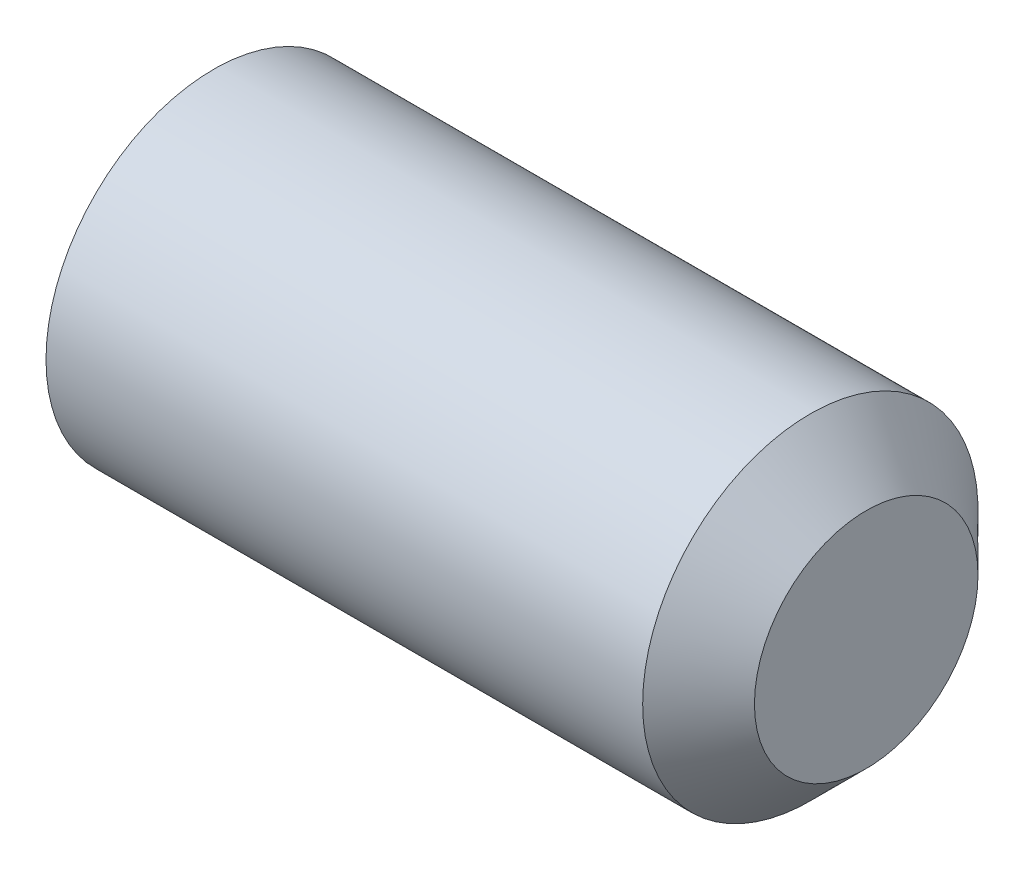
from build123d import *

# Parameters (mm, degrees)
HEX_2_DEPTH = 2.1


with BuildPart() as part:
    # BodySke → BaseBody (revolve)
    with BuildSketch(Plane.XY, mode=Mode.PRIVATE) as basebody_sk:
        Polygon((0, 0), (0, 1.2195), (0.161946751, 1.5), (5.5, 1.5), (6, 1), (6, 0), align=None)
    revolve(basebody_sk.sketch.rotate(Axis((-12.7, 0, 0), (1, 0, 0)), 90), axis=Axis((-12.7, 0, 0), (1, 0, 0)))

    # Sketch2 → Hex 2 (cut)
    with BuildSketch(Plane.ZY):
        Polygon((0.433012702, 0.75), (-0.433012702, 0.75), (-0.866025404, 0), (-0.433012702, -0.75), (0.433012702, -0.75), (0.866025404, 0), align=None)
    extrude(amount=-HEX_2_DEPTH, mode=Mode.SUBTRACT)


solid = part.part
